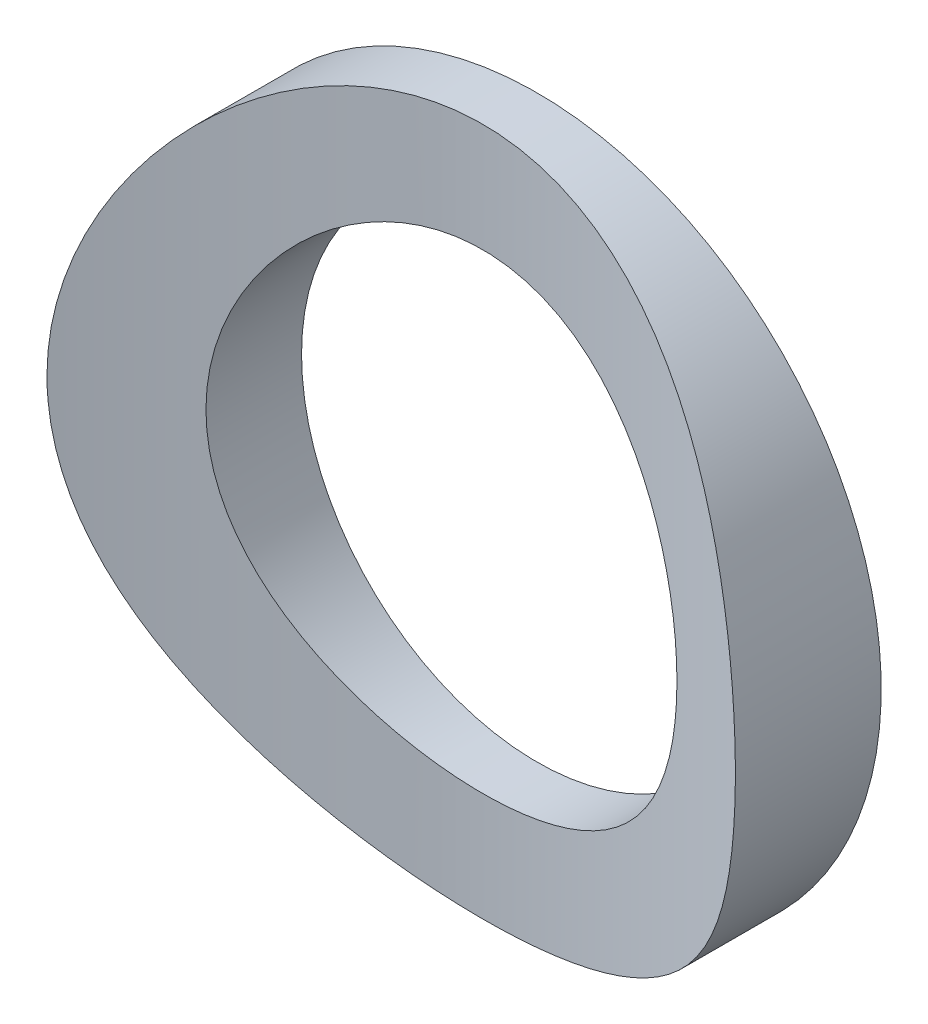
ISO-10303-21;
HEADER;
FILE_DESCRIPTION(('STEP AP214'),'2;1');
FILE_NAME('part.step','',(''),(''),'','','');
FILE_SCHEMA(('AUTOMOTIVE_DESIGN { 1 0 10303 214 1 1 1 1 }'));
ENDSEC;
DATA;
#1=APPLICATION_CONTEXT('core data for automotive mechanical design processes');
#2=APPLICATION_PROTOCOL_DEFINITION('international standard','automotive_design',2000,#1);
#3=PRODUCT_CONTEXT('',#1,'mechanical');
#4=PRODUCT('Part','Part','',(#3));
#5=PRODUCT_RELATED_PRODUCT_CATEGORY('part','',(#4));
#6=PRODUCT_DEFINITION_FORMATION('','',#4);
#7=PRODUCT_DEFINITION_CONTEXT('part definition',#1,'design');
#8=PRODUCT_DEFINITION('design','',#6,#7);
#9=PRODUCT_DEFINITION_SHAPE('','',#8);
#10=(LENGTH_UNIT() NAMED_UNIT(*) SI_UNIT(.MILLI.,.METRE.));
#11=(NAMED_UNIT(*) PLANE_ANGLE_UNIT() SI_UNIT($,.RADIAN.));
#12=(NAMED_UNIT(*) SI_UNIT($,.STERADIAN.) SOLID_ANGLE_UNIT());
#13=UNCERTAINTY_MEASURE_WITH_UNIT(LENGTH_MEASURE(1.E-05),#10,'distance_accuracy_value','');
#14=(GEOMETRIC_REPRESENTATION_CONTEXT(3) GLOBAL_UNCERTAINTY_ASSIGNED_CONTEXT((#13)) GLOBAL_UNIT_ASSIGNED_CONTEXT((#10,
#11,#12)) REPRESENTATION_CONTEXT('',''));
#15=CARTESIAN_POINT('',(0.,0.,0.));
#16=DIRECTION('',(0.,0.,1.));
#17=DIRECTION('',(1.,0.,0.));
#18=AXIS2_PLACEMENT_3D('',#15,#16,#17);
#19=CARTESIAN_POINT('',(0.,0.,8.10098934));
#20=DIRECTION('',(0.,0.,-1.));
#21=DIRECTION('',(-1.,0.,0.));
#22=AXIS2_PLACEMENT_3D('',#19,#20,#21);
#23=CYLINDRICAL_SURFACE('',#22,19.);
#24=CARTESIAN_POINT('',(0.,0.,0.));
#25=DIRECTION('',(0.,0.,-1.));
#26=DIRECTION('',(-1.,0.,0.));
#27=AXIS2_PLACEMENT_3D('',#24,#25,#26);
#28=CIRCLE('',#27,19.);
#29=CARTESIAN_POINT('',(-19.,0.,0.));
#30=VERTEX_POINT('',#29);
#31=EDGE_CURVE('E34',#30,#30,#28,.F.);
#32=ORIENTED_EDGE('',*,*,#31,.T.);
#33=EDGE_LOOP('',(#32));
#34=FACE_BOUND('',#33,.T.);
#35=CARTESIAN_POINT('',(-19.0000000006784,4.08830792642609E-09,8.05267330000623));
#36=CARTESIAN_POINT('',(-18.9999957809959,0.49602409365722,8.05266820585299));
#37=CARTESIAN_POINT('',(-18.9805477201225,0.99213072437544,8.04151664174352));
#38=CARTESIAN_POINT('',(-18.9030126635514,1.98038550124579,7.99732287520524));
#39=CARTESIAN_POINT('',(-18.8449169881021,2.47253273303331,7.96427575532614));
#40=CARTESIAN_POINT('',(-18.6907887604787,3.44952723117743,7.87748548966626));
#41=CARTESIAN_POINT('',(-18.594715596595,3.9343661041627,7.82372019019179));
#42=CARTESIAN_POINT('',(-18.3658340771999,4.89273805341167,7.69741920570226));
#43=CARTESIAN_POINT('',(-18.2330270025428,5.36627152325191,7.6248841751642));
#44=CARTESIAN_POINT('',(-17.9328901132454,6.29676602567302,7.46386720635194));
#45=CARTESIAN_POINT('',(-17.7657355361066,6.75379785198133,7.37546649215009));
#46=CARTESIAN_POINT('',(-17.3980693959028,7.65129925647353,7.18517214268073));
#47=CARTESIAN_POINT('',(-17.1975576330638,8.09176873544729,7.0832784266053));
#48=CARTESIAN_POINT('',(-16.764768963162,8.95406278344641,6.86885237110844));
#49=CARTESIAN_POINT('',(-16.5324933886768,9.37588813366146,6.75632047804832));
#50=CARTESIAN_POINT('',(-16.0376197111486,10.1992934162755,6.52346764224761));
#51=CARTESIAN_POINT('',(-15.7750104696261,10.6008658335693,6.40314384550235));
#52=CARTESIAN_POINT('',(-15.19850700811,11.4137366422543,6.1476473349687));
#53=CARTESIAN_POINT('',(-14.8821807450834,11.8231821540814,6.0120618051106));
#54=CARTESIAN_POINT('',(-14.2176137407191,12.61453379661,5.73871939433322));
#55=CARTESIAN_POINT('',(-13.8693713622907,12.9964385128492,5.60096240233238));
#56=CARTESIAN_POINT('',(-13.1424718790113,13.7310814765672,5.32662444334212));
#57=CARTESIAN_POINT('',(-12.7637963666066,14.0838018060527,5.19004424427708));
#58=CARTESIAN_POINT('',(-11.9781225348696,14.7577905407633,4.92150744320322));
#59=CARTESIAN_POINT('',(-11.5711337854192,15.0790694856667,4.78954930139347));
#60=CARTESIAN_POINT('',(-10.7025617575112,15.7086501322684,4.52484189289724));
#61=CARTESIAN_POINT('',(-10.2391476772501,16.0146578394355,4.39262664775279));
#62=CARTESIAN_POINT('',(-9.2847249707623,16.5862378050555,4.14070250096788));
#63=CARTESIAN_POINT('',(-8.7937147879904,16.851807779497,4.0209943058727));
#64=CARTESIAN_POINT('',(-7.78746216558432,17.3397784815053,3.79758517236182));
#65=CARTESIAN_POINT('',(-7.27223139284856,17.5621997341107,3.69387662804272));
#66=CARTESIAN_POINT('',(-6.22104369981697,17.9614758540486,3.50551562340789));
#67=CARTESIAN_POINT('',(-5.68508895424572,18.1383354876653,3.42086116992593));
#68=CARTESIAN_POINT('',(-4.63509149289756,18.4334494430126,3.27844384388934));
#69=CARTESIAN_POINT('',(-4.1221606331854,18.554951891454,3.21920787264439));
#70=CARTESIAN_POINT('',(-3.08607445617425,18.7551184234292,3.12114830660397));
#71=CARTESIAN_POINT('',(-2.56291957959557,18.8337843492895,3.08232383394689));
#72=CARTESIAN_POINT('',(-1.51098362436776,18.9472070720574,3.02622826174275));
#73=CARTESIAN_POINT('',(-0.982205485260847,18.9819857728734,3.00894641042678));
#74=CARTESIAN_POINT('',(0.0766553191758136,19.0072229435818,2.99641339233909));
#75=CARTESIAN_POINT('',(0.606737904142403,18.9976840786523,3.00116090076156));
#76=CARTESIAN_POINT('',(1.61811462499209,18.937155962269,3.03118532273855));
#77=CARTESIAN_POINT('',(2.09968508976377,18.8898009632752,3.05466210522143));
#78=CARTESIAN_POINT('',(3.05661660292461,18.7587388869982,3.11930987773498));
#79=CARTESIAN_POINT('',(3.53197808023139,18.6750343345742,3.16047963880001));
#80=CARTESIAN_POINT('',(4.47329598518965,18.4721807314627,3.25952570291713));
#81=CARTESIAN_POINT('',(4.93925214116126,18.3530306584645,3.31740248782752));
#82=CARTESIAN_POINT('',(5.85882029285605,18.0804928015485,3.44851250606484));
#83=CARTESIAN_POINT('',(6.31243184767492,17.9271037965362,3.52174628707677));
#84=CARTESIAN_POINT('',(7.21088778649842,17.5851457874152,3.68303562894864));
#85=CARTESIAN_POINT('',(7.65552244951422,17.3961171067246,3.77128319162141));
#86=CARTESIAN_POINT('',(8.52701465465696,16.9859347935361,3.9599031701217));
#87=CARTESIAN_POINT('',(8.95387221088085,16.7647811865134,4.06027557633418));
#88=CARTESIAN_POINT('',(9.78786071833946,16.2919495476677,4.27101507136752));
#89=CARTESIAN_POINT('',(10.1949872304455,16.0402646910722,4.38138439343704));
#90=CARTESIAN_POINT('',(10.9876701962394,15.5080320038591,4.60980644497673));
#91=CARTESIAN_POINT('',(11.3732245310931,15.2274813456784,4.72785992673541));
#92=CARTESIAN_POINT('',(12.156173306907,14.6115772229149,4.9805280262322));
#93=CARTESIAN_POINT('',(12.5513022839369,14.2735522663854,5.11565888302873));
#94=CARTESIAN_POINT('',(13.3120225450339,13.5668577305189,5.38893550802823));
#95=CARTESIAN_POINT('',(13.6776120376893,13.1981862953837,5.52708145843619));
#96=CARTESIAN_POINT('',(14.3778118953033,12.4317412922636,5.8030991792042));
#97=CARTESIAN_POINT('',(14.712393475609,12.0339412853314,5.9409705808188));
#98=CARTESIAN_POINT('',(15.3484241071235,11.2114291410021,6.21276266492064));
#99=CARTESIAN_POINT('',(15.6498740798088,10.7867177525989,6.34668345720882));
#100=CARTESIAN_POINT('',(16.2356638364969,9.88484576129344,6.61510504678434));
#101=CARTESIAN_POINT('',(16.5177434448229,9.40606629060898,6.74911505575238));
#102=CARTESIAN_POINT('',(17.0401401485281,8.42279931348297,7.00411448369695));
#103=CARTESIAN_POINT('',(17.2804516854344,7.91830839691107,7.12510216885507));
#104=CARTESIAN_POINT('',(17.7164162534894,6.88774562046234,7.34939353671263));
#105=CARTESIAN_POINT('',(17.9121536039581,6.36171676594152,7.45273051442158));
#106=CARTESIAN_POINT('',(18.2570791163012,5.29103418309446,7.63779979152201));
#107=CARTESIAN_POINT('',(18.4062877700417,4.74638877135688,7.71954159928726));
#108=CARTESIAN_POINT('',(18.6086176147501,3.85260630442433,7.83159833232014));
#109=CARTESIAN_POINT('',(18.676712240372,3.50774791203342,7.86965562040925));
#110=CARTESIAN_POINT('',(18.7937765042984,2.81383996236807,7.93542348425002));
#111=CARTESIAN_POINT('',(18.8427488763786,2.46479101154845,7.9631355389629));
#112=CARTESIAN_POINT('',(18.9212400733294,1.76381852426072,8.00768936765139));
#113=CARTESIAN_POINT('',(18.9507588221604,1.41189497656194,8.02453109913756));
#114=CARTESIAN_POINT('',(18.9901388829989,0.706661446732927,8.04702407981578));
#115=CARTESIAN_POINT('',(19.0000030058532,0.353351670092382,8.05267692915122));
#116=CARTESIAN_POINT('',(18.9999957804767,-0.496024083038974,8.05266820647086));
#117=CARTESIAN_POINT('',(18.9805477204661,-0.992130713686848,8.04151664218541));
#118=CARTESIAN_POINT('',(18.9030126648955,-1.9803854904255,7.99732287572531));
#119=CARTESIAN_POINT('',(18.8449169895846,-2.47253272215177,7.96427575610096));
#120=CARTESIAN_POINT('',(18.6907887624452,-3.44952722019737,7.8774854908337));
#121=CARTESIAN_POINT('',(18.5947155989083,-3.93436609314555,7.82372019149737));
#122=CARTESIAN_POINT('',(18.3658340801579,-4.89273804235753,7.69741920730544));
#123=CARTESIAN_POINT('',(18.2330270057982,-5.36627151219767,7.62488417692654));
#124=CARTESIAN_POINT('',(17.9328901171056,-6.29676601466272,7.46386720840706));
#125=CARTESIAN_POINT('',(17.765735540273,-6.75379784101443,7.37546649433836));
#126=CARTESIAN_POINT('',(17.3980694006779,-7.65129924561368,7.18517214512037));
#127=CARTESIAN_POINT('',(17.1975576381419,-8.09176872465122,7.08327842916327));
#128=CARTESIAN_POINT('',(16.7647689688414,-8.95406277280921,6.86885237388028));
#129=CARTESIAN_POINT('',(16.5324933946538,-9.37588812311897,6.7563204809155));
#130=CARTESIAN_POINT('',(16.0376197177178,-10.199293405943,6.52346764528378));
#131=CARTESIAN_POINT('',(15.77501047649,-10.6008658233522,6.40314384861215));
#132=CARTESIAN_POINT('',(15.1985070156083,-11.4137366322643,6.14764733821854));
#133=CARTESIAN_POINT('',(14.882180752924,-11.8231821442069,6.01206180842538));
#134=CARTESIAN_POINT('',(14.2176137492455,-12.6145337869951,5.73871939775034));
#135=CARTESIAN_POINT('',(13.8693713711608,-12.9964385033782,5.6009624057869));
#136=CARTESIAN_POINT('',(13.142471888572,-13.7310814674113,5.32662444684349));
#137=CARTESIAN_POINT('',(12.7637963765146,-14.0838017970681,5.19004424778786));
#138=CARTESIAN_POINT('',(11.9781225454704,-14.7577905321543,4.92150744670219));
#139=CARTESIAN_POINT('',(11.5711337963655,-15.0790694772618,4.78954930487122));
#140=CARTESIAN_POINT('',(10.7025617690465,-15.7086501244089,4.52484189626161));
#141=CARTESIAN_POINT('',(10.2391476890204,-16.0146578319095,4.39262665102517));
#142=CARTESIAN_POINT('',(9.28472498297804,-16.5862377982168,4.14070250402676));
#143=CARTESIAN_POINT('',(8.79371480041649,-16.8518077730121,4.02099430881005));
#144=CARTESIAN_POINT('',(7.78746217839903,-17.3397784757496,3.79758517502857));
#145=CARTESIAN_POINT('',(7.27223140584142,-17.5621997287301,3.69387663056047));
#146=CARTESIAN_POINT('',(6.2210437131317,-17.9614758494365,3.50551562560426));
#147=CARTESIAN_POINT('',(5.68508896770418,-18.1383354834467,3.42086117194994));
#148=CARTESIAN_POINT('',(4.63509150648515,-18.433449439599,3.27844384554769));
#149=CARTESIAN_POINT('',(4.12216064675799,-18.5549518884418,3.2192078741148));
#150=CARTESIAN_POINT('',(3.08607446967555,-18.7551184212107,3.12114830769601));
#151=CARTESIAN_POINT('',(2.56291959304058,-18.8337843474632,3.08232383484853));
#152=CARTESIAN_POINT('',(1.51098363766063,-18.9472070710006,3.02622826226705));
#153=CARTESIAN_POINT('',(0.982205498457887,-18.981985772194,3.00894641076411));
#154=CARTESIAN_POINT('',(-0.076655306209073,-19.0072229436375,2.99641339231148));
#155=CARTESIAN_POINT('',(-0.606737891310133,-18.9976840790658,3.00116090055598));
#156=CARTESIAN_POINT('',(-1.618114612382,-18.9371559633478,3.03118532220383));
#157=CARTESIAN_POINT('',(-2.09968507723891,-18.8898009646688,3.0546621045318));
#158=CARTESIAN_POINT('',(-3.05661659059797,-18.7587388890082,3.11930987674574));
#159=CARTESIAN_POINT('',(-3.53197806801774,-18.6750343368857,3.16047963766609));
#160=CARTESIAN_POINT('',(-4.47329597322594,-18.4721807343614,3.25952570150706));
#161=CARTESIAN_POINT('',(-4.93925212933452,-18.353030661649,3.31740248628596));
#162=CARTESIAN_POINT('',(-5.85882028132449,-18.0804928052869,3.44851250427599));
#163=CARTESIAN_POINT('',(-6.31243183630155,-17.9271038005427,3.52174628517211));
#164=CARTESIAN_POINT('',(-7.2108877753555,-17.5851457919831,3.68303562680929));
#165=CARTESIAN_POINT('',(-7.65552243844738,-17.3961171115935,3.77128318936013));
#166=CARTESIAN_POINT('',(-8.52701464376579,-16.9859347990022,3.95990316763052));
#167=CARTESIAN_POINT('',(-8.95387220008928,-16.7647811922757,4.06027557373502));
#168=CARTESIAN_POINT('',(-9.78786070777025,-16.291949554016,4.271015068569));
#169=CARTESIAN_POINT('',(-10.194987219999,-16.0402646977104,4.38138439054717));
#170=CARTESIAN_POINT('',(-10.9876701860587,-15.5080320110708,4.60980644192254));
#171=CARTESIAN_POINT('',(-11.3732245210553,-15.2274813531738,4.72785992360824));
#172=CARTESIAN_POINT('',(-12.1561732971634,-14.611577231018,4.98052802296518));
#173=CARTESIAN_POINT('',(-12.5513022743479,-14.2735522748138,5.11565887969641));
#174=CARTESIAN_POINT('',(-13.3120225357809,-13.5668577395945,5.38893550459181));
#175=CARTESIAN_POINT('',(-13.6776120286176,-13.1981863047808,5.52708145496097));
#176=CARTESIAN_POINT('',(-14.3778118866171,-12.4317413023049,5.80309917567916));
#177=CARTESIAN_POINT('',(-14.7123934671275,-12.0339412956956,5.94097057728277));
#178=CARTESIAN_POINT('',(-15.3484240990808,-11.2114291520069,6.21276266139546));
#179=CARTESIAN_POINT('',(-15.6498740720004,-10.7867177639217,6.34668345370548));
#180=CARTESIAN_POINT('',(-16.2356638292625,-9.88484577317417,6.61510504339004));
#181=CARTESIAN_POINT('',(-16.5177434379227,-9.40606630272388,6.74911505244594));
#182=CARTESIAN_POINT('',(-17.0401401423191,-8.42279932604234,7.00411448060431));
#183=CARTESIAN_POINT('',(-17.2804516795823,-7.91830840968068,7.12510216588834));
#184=CARTESIAN_POINT('',(-17.7164162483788,-6.88774563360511,7.34939353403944));
#185=CARTESIAN_POINT('',(-17.9121535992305,-6.36171677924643,7.4527305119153));
#186=CARTESIAN_POINT('',(-18.2570791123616,-5.29103419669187,7.6377997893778));
#187=CARTESIAN_POINT('',(-18.4062877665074,-4.74638878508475,7.71954159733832));
#188=CARTESIAN_POINT('',(-18.6086176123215,-3.85260631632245,7.83159833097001));
#189=CARTESIAN_POINT('',(-18.6767122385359,-3.50774792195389,7.86965561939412));
#190=CARTESIAN_POINT('',(-18.7937765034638,-2.81383996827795,7.9354234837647));
#191=CARTESIAN_POINT('',(-18.8427488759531,-2.46479101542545,7.9631355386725));
#192=CARTESIAN_POINT('',(-18.9212400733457,-1.76381852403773,8.00768936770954));
#193=CARTESIAN_POINT('',(-18.9507588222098,-1.41189497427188,8.02453109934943));
#194=CARTESIAN_POINT('',(-18.9901388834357,-0.70666144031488,8.04702407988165));
#195=CARTESIAN_POINT('',(-19.000003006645,-0.353351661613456,8.05267692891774));
#196=CARTESIAN_POINT('',(-19.0000000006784,4.08830792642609E-09,8.05267330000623));
#197=B_SPLINE_CURVE_WITH_KNOTS('',3,(#35,#36,#37,#38,#39,#40,#41,#42,#43,#44,#45,#46,#47,#48,
#49,#50,#51,#52,#53,#54,#55,#56,#57,#58,#59,#60,#61,#62,#63,#64,#65,#66,#67,#68,#69,#70,#71,#72,
#73,#74,#75,#76,#77,#78,#79,#80,#81,#82,#83,#84,#85,#86,#87,#88,#89,#90,#91,#92,#93,#94,#95,#96,
#97,#98,#99,#100,#101,#102,#103,#104,#105,#106,#107,#108,#109,#110,#111,#112,#113,#114,#115,
#116,#117,#118,#119,#120,#121,#122,#123,#124,#125,#126,#127,#128,#129,#130,#131,#132,#133,#134,
#135,#136,#137,#138,#139,#140,#141,#142,#143,#144,#145,#146,#147,#148,#149,#150,#151,#152,#153,
#154,#155,#156,#157,#158,#159,#160,#161,#162,#163,#164,#165,#166,#167,#168,#169,#170,#171,#172,
#173,#174,#175,#176,#177,#178,#179,#180,#181,#182,#183,#184,#185,#186,#187,#188,#189,#190,#191,
#192,#193,#194,#195,#196),.UNSPECIFIED.,.T.,.F.,(4,2,2,2,2,2,2,2,2,2,2,2,2,2,2,2,2,2,2,2,2,2,2,
2,2,2,2,2,2,2,2,2,2,2,2,2,2,2,2,2,2,2,2,2,2,2,2,2,2,2,2,2,2,2,2,2,2,2,2,2,2,2,2,2,2,2,2,2,2,2,2,
2,2,2,2,2,2,2,2,2,4),(0.,1.48771397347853,2.97576218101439,4.46540597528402,5.95499783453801,
7.4371706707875,8.9193523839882,10.4014719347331,11.8841374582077,13.4870586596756,
15.0900621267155,16.6940425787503,18.2974834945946,20.0078474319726,21.7183079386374,
23.4279528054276,25.1374187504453,26.7265962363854,28.3157053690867,29.904021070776,
31.4922412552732,32.9439124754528,34.3954828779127,35.847095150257,37.2987592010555,
38.7706159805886,40.2424715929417,41.7146568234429,43.1869864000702,44.797025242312,
46.4071616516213,48.0187780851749,49.6303496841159,51.3430337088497,53.0559454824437,
54.7655895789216,56.4744796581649,57.5345784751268,58.5945256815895,59.6544770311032,
60.7142767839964,62.2019907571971,63.690038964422,65.1796827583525,66.6692746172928,
68.1514474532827,69.6336291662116,71.1157487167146,72.5984142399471,74.2013354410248,
75.8043389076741,77.408319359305,79.0117602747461,80.7221242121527,82.432584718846,
84.1422295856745,85.8516955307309,87.4408730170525,89.0299821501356,90.6182978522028,
92.2065180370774,93.6581892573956,95.1097596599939,96.5613719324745,98.0130359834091,
99.4848927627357,100.956748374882,102.428933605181,103.901263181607,105.511302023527,
107.121438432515,108.733054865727,110.344626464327,112.05731048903,113.770222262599,
115.479866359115,117.188756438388,118.248855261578,119.308802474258,120.368753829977,
121.428553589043),.UNSPECIFIED.);
#198=CARTESIAN_POINT('',(-19.0000000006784,4.08830792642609E-09,8.05267330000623));
#199=VERTEX_POINT('',#198);
#200=EDGE_CURVE('E43',#199,#199,#197,.T.);
#201=ORIENTED_EDGE('',*,*,#200,.T.);
#202=EDGE_LOOP('',(#201));
#203=FACE_BOUND('',#202,.T.);
#204=ADVANCED_FACE('F30',(#34,#203),#23,.T.);
#205=CARTESIAN_POINT('',(-19.228,-19.29416296,0.));
#206=DIRECTION('',(0.,0.,1.));
#207=DIRECTION('',(1.,0.,0.));
#208=AXIS2_PLACEMENT_3D('',#205,#206,#207);
#209=PLANE('',#208);
#210=CARTESIAN_POINT('',(0.,0.,0.));
#211=DIRECTION('',(0.,0.,-1.));
#212=DIRECTION('',(-1.,0.,0.));
#213=AXIS2_PLACEMENT_3D('',#210,#211,#212);
#214=CIRCLE('',#213,13.);
#215=CARTESIAN_POINT('',(-13.,0.,0.));
#216=VERTEX_POINT('',#215);
#217=EDGE_CURVE('E38',#216,#216,#214,.F.);
#218=ORIENTED_EDGE('',*,*,#217,.T.);
#219=EDGE_LOOP('',(#218));
#220=FACE_BOUND('',#219,.T.);
#221=ORIENTED_EDGE('',*,*,#31,.F.);
#222=EDGE_LOOP('',(#221));
#223=FACE_BOUND('',#222,.T.);
#224=ADVANCED_FACE('F32',(#220,#223),#209,.F.);
#225=CARTESIAN_POINT('',(0.,-19.2283897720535,41.25));
#226=DIRECTION('',(0.,1.,0.));
#227=DIRECTION('',(0.,0.,1.));
#228=AXIS2_PLACEMENT_3D('',#225,#226,#227);
#229=CYLINDRICAL_SURFACE('',#228,38.25);
#230=CARTESIAN_POINT('',(13.0000000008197,8.88697038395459E-10,5.27691978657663));
#231=CARTESIAN_POINT('',(12.9999999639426,-0.35324621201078,5.27691971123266));
#232=CARTESIAN_POINT('',(12.9855896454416,-0.706494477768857,5.27170234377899));
#233=CARTESIAN_POINT('',(12.9280833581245,-1.4104730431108,5.25099879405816));
#234=CARTESIAN_POINT('',(12.8849766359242,-1.76120234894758,5.23550876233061));
#235=CARTESIAN_POINT('',(12.7704105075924,-2.45793391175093,5.19472565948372));
#236=CARTESIAN_POINT('',(12.6989103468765,-2.8039286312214,5.16941849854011));
#237=CARTESIAN_POINT('',(12.5282306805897,-3.48823757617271,5.10979948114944));
#238=CARTESIAN_POINT('',(12.4290497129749,-3.82655139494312,5.07548714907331));
#239=CARTESIAN_POINT('',(12.2041972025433,-4.49229151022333,4.99901218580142));
#240=CARTESIAN_POINT('',(12.0785986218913,-4.81974497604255,4.95687121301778));
#241=CARTESIAN_POINT('',(11.8017706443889,-5.4626654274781,4.86591114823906));
#242=CARTESIAN_POINT('',(11.6505407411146,-5.77813217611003,4.81709192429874));
#243=CARTESIAN_POINT('',(11.3236303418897,-6.39509513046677,4.71416501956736));
#244=CARTESIAN_POINT('',(11.147957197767,-6.69659550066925,4.66005893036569));
#245=CARTESIAN_POINT('',(10.7732673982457,-7.28410234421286,4.54799122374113));
#246=CARTESIAN_POINT('',(10.5742429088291,-7.57010357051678,4.49002831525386));
#247=CARTESIAN_POINT('',(10.1463858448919,-8.13517289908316,4.36959140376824));
#248=CARTESIAN_POINT('',(9.91672368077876,-8.41359451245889,4.30702985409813));
#249=CARTESIAN_POINT('',(9.4351567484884,-8.95029686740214,4.18111485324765));
#250=CARTESIAN_POINT('',(9.18325152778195,-9.20857719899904,4.11776138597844));
#251=CARTESIAN_POINT('',(8.65862792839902,-9.70351780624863,3.99193455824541));
#252=CARTESIAN_POINT('',(8.38590144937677,-9.94016958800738,3.92946155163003));
#253=CARTESIAN_POINT('',(7.82145300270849,-10.3901442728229,3.8071004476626));
#254=CARTESIAN_POINT('',(7.52973771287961,-10.6034753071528,3.74721145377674));
#255=CARTESIAN_POINT('',(6.92071477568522,-11.0109763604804,3.62999245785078));
#256=CARTESIAN_POINT('',(6.60292415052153,-11.2044587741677,3.57277799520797));
#257=CARTESIAN_POINT('',(5.95112082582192,-11.5638515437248,3.46434401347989));
#258=CARTESIAN_POINT('',(5.61710774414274,-11.7297612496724,3.41312463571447));
#259=CARTESIAN_POINT('',(4.93523223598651,-12.0325644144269,3.31816070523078));
#260=CARTESIAN_POINT('',(4.58737289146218,-12.1694642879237,3.2744145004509));
#261=CARTESIAN_POINT('',(3.8802658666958,-12.4130313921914,3.19566314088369));
#262=CARTESIAN_POINT('',(3.52101869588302,-12.5196999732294,3.16065759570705));
#263=CARTESIAN_POINT('',(2.80699492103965,-12.6984765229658,3.10151441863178));
#264=CARTESIAN_POINT('',(2.45252409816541,-12.7716918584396,3.07703046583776));
#265=CARTESIAN_POINT('',(1.7381808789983,-12.8883547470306,3.03784014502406));
#266=CARTESIAN_POINT('',(1.37830860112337,-12.9318029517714,3.02313356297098));
#267=CARTESIAN_POINT('',(0.656003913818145,-12.9884897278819,3.00391976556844));
#268=CARTESIAN_POINT('',(0.293572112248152,-13.0017352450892,2.99941020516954));
#269=CARTESIAN_POINT('',(-0.431108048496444,-12.9979009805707,3.00071342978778));
#270=CARTESIAN_POINT('',(-0.793356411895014,-12.9808219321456,3.00652596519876));
#271=CARTESIAN_POINT('',(-1.50011444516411,-12.9178307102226,3.02785950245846));
#272=CARTESIAN_POINT('',(-1.84474463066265,-12.8731238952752,3.04297454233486));
#273=CARTESIAN_POINT('',(-2.52881682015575,-12.7563895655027,3.08214764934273));
#274=CARTESIAN_POINT('',(-2.8682589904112,-12.6843629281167,3.10620542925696));
#275=CARTESIAN_POINT('',(-3.53966262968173,-12.5136239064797,3.16264253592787));
#276=CARTESIAN_POINT('',(-3.87162379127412,-12.4149104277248,3.19502220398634));
#277=CARTESIAN_POINT('',(-4.52589145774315,-12.191628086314,3.26727834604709));
#278=CARTESIAN_POINT('',(-4.84819774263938,-12.0670586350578,3.30715499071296));
#279=CARTESIAN_POINT('',(-5.48538802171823,-11.7912109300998,3.39398602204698));
#280=CARTESIAN_POINT('',(-5.8001148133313,-11.6395973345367,3.44102804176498));
#281=CARTESIAN_POINT('',(-6.41568095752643,-11.3119676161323,3.54060112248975));
#282=CARTESIAN_POINT('',(-6.71652025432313,-11.1359513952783,3.59313220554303));
#283=CARTESIAN_POINT('',(-7.30257230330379,-10.7607388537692,3.70237960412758));
#284=CARTESIAN_POINT('',(-7.58778495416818,-10.5615423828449,3.7590959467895));
#285=CARTESIAN_POINT('',(-8.14108654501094,-10.1411772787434,3.87534053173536));
#286=CARTESIAN_POINT('',(-8.40916884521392,-9.9200002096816,3.93486984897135));
#287=CARTESIAN_POINT('',(-8.93911688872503,-9.44587861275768,4.05816975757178));
#288=CARTESIAN_POINT('',(-9.2000570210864,-9.19191571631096,4.12200632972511));
#289=CARTESIAN_POINT('',(-9.6998722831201,-8.66285037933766,4.24943863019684));
#290=CARTESIAN_POINT('',(-9.93873700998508,-8.38773808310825,4.31303423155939));
#291=CARTESIAN_POINT('',(-10.3928632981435,-7.81800253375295,4.43822998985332));
#292=CARTESIAN_POINT('',(-10.6081124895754,-7.52336918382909,4.49982908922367));
#293=CARTESIAN_POINT('',(-11.0133043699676,-6.91665619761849,4.61921743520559));
#294=CARTESIAN_POINT('',(-11.2032589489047,-6.60458485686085,4.67700846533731));
#295=CARTESIAN_POINT('',(-11.5595140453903,-5.95949895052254,4.78802610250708));
#296=CARTESIAN_POINT('',(-11.7253705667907,-5.62622307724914,4.84116123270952));
#297=CARTESIAN_POINT('',(-12.0281644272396,-4.94589001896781,4.94006832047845));
#298=CARTESIAN_POINT('',(-12.1651139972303,-4.59883873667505,4.98584339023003));
#299=CARTESIAN_POINT('',(-12.4087325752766,-3.8938678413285,5.06847996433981));
#300=CARTESIAN_POINT('',(-12.5154508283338,-3.53596696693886,5.10535595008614));
#301=CARTESIAN_POINT('',(-12.6978054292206,-2.81160807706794,5.16901349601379));
#302=CARTESIAN_POINT('',(-12.7734560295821,-2.44515406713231,5.19579968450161));
#303=CARTESIAN_POINT('',(-12.8886217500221,-1.73318203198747,5.23681665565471));
#304=CARTESIAN_POINT('',(-12.9303534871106,-1.38806522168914,5.25181499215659));
#305=CARTESIAN_POINT('',(-12.9860426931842,-0.695299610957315,5.27186661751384));
#306=CARTESIAN_POINT('',(-13.0000000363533,-0.347650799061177,5.27691986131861));
#307=CARTESIAN_POINT('',(-12.9999999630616,0.353246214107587,5.27691971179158));
#308=CARTESIAN_POINT('',(-12.9855896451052,0.706494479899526,5.27170234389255));
#309=CARTESIAN_POINT('',(-12.9280833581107,1.41047304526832,5.25099879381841));
#310=CARTESIAN_POINT('',(-12.8849766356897,1.76120235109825,5.23550876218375));
#311=CARTESIAN_POINT('',(-12.7704105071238,2.45793391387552,5.19472565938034));
#312=CARTESIAN_POINT('',(-12.6989103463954,2.80392863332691,5.16941849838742));
#313=CARTESIAN_POINT('',(-12.5282306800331,3.48823757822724,5.10979948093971));
#314=CARTESIAN_POINT('',(-12.429049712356,3.82655139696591,5.07548714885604));
#315=CARTESIAN_POINT('',(-12.2041972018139,4.49229151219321,4.99901218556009));
#316=CARTESIAN_POINT('',(-12.0785986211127,4.81974497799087,4.95687121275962));
#317=CARTESIAN_POINT('',(-11.8017706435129,5.4626654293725,4.86591114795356));
#318=CARTESIAN_POINT('',(-11.6505407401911,5.77813217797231,4.81709192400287));
#319=CARTESIAN_POINT('',(-11.3236303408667,6.39509513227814,4.71416501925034));
#320=CARTESIAN_POINT('',(-11.1479571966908,6.69659550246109,4.66005893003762));
#321=CARTESIAN_POINT('',(-10.7732673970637,7.28410234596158,4.54799122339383));
#322=CARTESIAN_POINT('',(-10.5742429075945,7.5701035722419,4.49002831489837));
#323=CARTESIAN_POINT('',(-10.1463858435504,8.13517290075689,4.36959140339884));
#324=CARTESIAN_POINT('',(-9.91672367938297,8.41359451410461,4.3070298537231));
#325=CARTESIAN_POINT('',(-9.43515674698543,8.95029686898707,4.18111485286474));
#326=CARTESIAN_POINT('',(-9.18325152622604,9.20857720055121,4.11776138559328));
#327=CARTESIAN_POINT('',(-8.65862792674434,9.70351780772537,3.99193455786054));
#328=CARTESIAN_POINT('',(-8.38590144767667,9.9401695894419,3.9294615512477));
#329=CARTESIAN_POINT('',(-7.82145300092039,10.3901442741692,3.80710044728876));
#330=CARTESIAN_POINT('',(-7.52973771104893,10.6034753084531,3.74721145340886));
#331=CARTESIAN_POINT('',(-6.9207147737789,11.0109763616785,3.62999245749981));
#332=CARTESIAN_POINT('',(-6.60292414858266,11.2044587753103,3.57277799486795));
#333=CARTESIAN_POINT('',(-5.95112082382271,11.5638515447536,3.46434401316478));
#334=CARTESIAN_POINT('',(-5.61710774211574,11.729761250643,3.41312463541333));
#335=CARTESIAN_POINT('',(-4.9352322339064,12.0325644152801,3.31816070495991));
#336=CARTESIAN_POINT('',(-4.58737288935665,12.1694642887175,3.27441450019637));
#337=CARTESIAN_POINT('',(-3.8802658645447,12.4130313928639,3.19566314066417));
#338=CARTESIAN_POINT('',(-3.52101869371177,12.5196999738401,3.16065759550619));
#339=CARTESIAN_POINT('',(-2.80699491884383,12.6984765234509,3.10151441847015));
#340=CARTESIAN_POINT('',(-2.45252409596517,12.7716918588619,3.0770304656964));
#341=CARTESIAN_POINT('',(-1.73818087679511,12.8883547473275,3.03784014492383));
#342=CARTESIAN_POINT('',(-1.37830859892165,12.9318029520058,3.02313356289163));
#343=CARTESIAN_POINT('',(-0.656003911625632,12.9884897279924,3.00391976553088));
#344=CARTESIAN_POINT('',(-0.293572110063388,13.0017352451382,2.99941020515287));
#345=CARTESIAN_POINT('',(0.431108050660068,12.9979009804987,3.00071342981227));
#346=CARTESIAN_POINT('',(0.793356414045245,12.9808219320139,3.00652596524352));
#347=CARTESIAN_POINT('',(1.50011444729,12.9178307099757,3.02785950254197));
#348=CARTESIAN_POINT('',(1.84474463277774,12.873123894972,3.04297454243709));
#349=CARTESIAN_POINT('',(2.52881682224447,12.7563895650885,3.08214764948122));
#350=CARTESIAN_POINT('',(2.86825899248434,12.6843629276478,3.106205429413));
#351=CARTESIAN_POINT('',(3.53966263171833,12.5136239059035,3.1626425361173));
#352=CARTESIAN_POINT('',(3.87162379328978,12.414910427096,3.1950222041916));
#353=CARTESIAN_POINT('',(4.52589145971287,12.1916280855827,3.26727834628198));
#354=CARTESIAN_POINT('',(4.84819774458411,12.0670586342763,3.30715499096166));
#355=CARTESIAN_POINT('',(5.48538802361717,11.7912109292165,3.39398602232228));
#356=CARTESIAN_POINT('',(5.80011481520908,11.6395973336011,3.44102804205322));
#357=CARTESIAN_POINT('',(6.41568095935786,11.3119676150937,3.54060112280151));
#358=CARTESIAN_POINT('',(6.71652025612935,11.135951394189,3.59313220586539));
#359=CARTESIAN_POINT('',(7.30257230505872,10.7607388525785,3.70237960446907));
#360=CARTESIAN_POINT('',(7.58778495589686,10.5615423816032,3.75909594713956));
#361=CARTESIAN_POINT('',(8.14108654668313,10.1411772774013,3.87534053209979));
#362=CARTESIAN_POINT('',(8.40916884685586,9.92000020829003,3.93486984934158));
#363=CARTESIAN_POINT('',(8.9391168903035,9.44587861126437,4.05816975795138));
#364=CARTESIAN_POINT('',(9.20005702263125,9.19191571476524,4.12200633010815));
#365=CARTESIAN_POINT('',(9.69987228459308,8.6628503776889,4.24943863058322));
#366=CARTESIAN_POINT('',(9.93873701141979,8.38773808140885,4.31303423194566));
#367=CARTESIAN_POINT('',(10.3928632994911,7.8180025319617,4.43822999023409));
#368=CARTESIAN_POINT('',(10.6081124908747,7.52336918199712,4.4998290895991));
#369=CARTESIAN_POINT('',(11.0133043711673,6.91665619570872,4.61921743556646));
#370=CARTESIAN_POINT('',(11.203258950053,6.604584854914,4.67700846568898));
#371=CARTESIAN_POINT('',(11.5595140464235,5.9594989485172,4.78802610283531));
#372=CARTESIAN_POINT('',(11.7253705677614,5.62622307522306,4.84116123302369));
#373=CARTESIAN_POINT('',(12.028164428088,4.9458900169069,4.94006832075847));
#374=CARTESIAN_POINT('',(12.1651139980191,4.5988387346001,4.98584339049));
#375=CARTESIAN_POINT('',(12.4087325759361,3.89386783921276,5.06847996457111));
#376=CARTESIAN_POINT('',(12.515450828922,3.53596696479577,5.10535595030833));
#377=CARTESIAN_POINT('',(12.697805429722,2.81160807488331,5.16901349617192));
#378=CARTESIAN_POINT('',(12.7734560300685,2.44515406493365,5.19579968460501));
#379=CARTESIAN_POINT('',(12.8886217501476,1.73318203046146,5.2368166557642));
#380=CARTESIAN_POINT('',(12.9303534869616,1.38806522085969,5.25181499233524));
#381=CARTESIAN_POINT('',(12.9860426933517,0.695299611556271,5.27186661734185));
#382=CARTESIAN_POINT('',(13.0000000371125,0.347650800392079,5.27691986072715));
#383=CARTESIAN_POINT('',(13.0000000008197,8.88697038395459E-10,5.27691978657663));
#384=B_SPLINE_CURVE_WITH_KNOTS('',3,(#230,#231,#232,#233,#234,#235,#236,#237,#238,#239,#240,
#241,#242,#243,#244,#245,#246,#247,#248,#249,#250,#251,#252,#253,#254,#255,#256,#257,#258,#259,
#260,#261,#262,#263,#264,#265,#266,#267,#268,#269,#270,#271,#272,#273,#274,#275,#276,#277,#278,
#279,#280,#281,#282,#283,#284,#285,#286,#287,#288,#289,#290,#291,#292,#293,#294,#295,#296,#297,
#298,#299,#300,#301,#302,#303,#304,#305,#306,#307,#308,#309,#310,#311,#312,#313,#314,#315,#316,
#317,#318,#319,#320,#321,#322,#323,#324,#325,#326,#327,#328,#329,#330,#331,#332,#333,#334,#335,
#336,#337,#338,#339,#340,#341,#342,#343,#344,#345,#346,#347,#348,#349,#350,#351,#352,#353,#354,
#355,#356,#357,#358,#359,#360,#361,#362,#363,#364,#365,#366,#367,#368,#369,#370,#371,#372,#373,
#374,#375,#376,#377,#378,#379,#380,#381,#382,#383),.UNSPECIFIED.,.T.,.F.,(4,2,2,2,2,2,2,2,2,2,2,
2,2,2,2,2,2,2,2,2,2,2,2,2,2,2,2,2,2,2,2,2,2,2,2,2,2,2,2,2,2,2,2,2,2,2,2,2,2,2,2,2,2,2,2,2,2,2,2,
2,2,2,2,2,2,2,2,2,2,2,2,2,2,2,2,2,4),(0.,1.05941171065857,2.11922063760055,3.18055629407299,
4.2419480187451,5.30044592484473,6.3589647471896,7.41716588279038,8.4757230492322,
9.57338755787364,10.6710744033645,11.7691904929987,12.8669224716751,13.9948188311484,
15.1227417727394,16.2504150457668,17.3780379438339,18.4650065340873,19.5519513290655,
20.6386461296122,21.7253146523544,22.7676278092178,23.8099074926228,24.8522299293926,
25.8945760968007,26.9508813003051,28.0071907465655,29.0635070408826,30.1202303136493,
31.2279915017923,32.3362720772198,33.4451304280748,34.5534656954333,35.680162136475,
36.8063808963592,37.93075442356,39.0546115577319,40.097237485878,41.1398681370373,
42.199279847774,43.2590887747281,44.3204244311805,45.3818161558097,46.4403140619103,
47.4988328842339,48.5570340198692,49.6155911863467,50.7132556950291,51.8109425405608,
52.9090586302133,54.006790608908,55.134686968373,56.2626099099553,57.3902831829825,
58.5179060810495,59.6048746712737,60.6918194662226,61.7785142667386,62.8651827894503,
63.9074959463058,64.9497756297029,65.9920980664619,67.0344442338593,68.0907494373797,
69.1470588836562,70.2033751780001,71.2600984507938,72.3678596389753,73.4761402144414,
74.5849985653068,75.6933338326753,76.8200302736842,77.9462490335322,79.0706225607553,
80.1944796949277,81.2371056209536,82.2797362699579),.UNSPECIFIED.);
#385=CARTESIAN_POINT('',(13.0000000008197,8.88697038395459E-10,5.27691978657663));
#386=VERTEX_POINT('',#385);
#387=EDGE_CURVE('E10',#386,#386,#384,.T.);
#388=ORIENTED_EDGE('',*,*,#387,.T.);
#389=EDGE_LOOP('',(#388));
#390=FACE_BOUND('',#389,.T.);
#391=ORIENTED_EDGE('',*,*,#200,.F.);
#392=EDGE_LOOP('',(#391));
#393=FACE_BOUND('',#392,.T.);
#394=ADVANCED_FACE('F49',(#390,#393),#229,.F.);
#395=CARTESIAN_POINT('',(0.,0.,5.308581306));
#396=DIRECTION('',(0.,0.,-1.));
#397=DIRECTION('',(-1.,0.,0.));
#398=AXIS2_PLACEMENT_3D('',#395,#396,#397);
#399=CYLINDRICAL_SURFACE('',#398,13.);
#400=ORIENTED_EDGE('',*,*,#217,.F.);
#401=EDGE_LOOP('',(#400));
#402=FACE_BOUND('',#401,.T.);
#403=ORIENTED_EDGE('',*,*,#387,.F.);
#404=EDGE_LOOP('',(#403));
#405=FACE_BOUND('',#404,.T.);
#406=ADVANCED_FACE('F52',(#402,#405),#399,.F.);
#407=CLOSED_SHELL('',(#204,#224,#394,#406));
#408=MANIFOLD_SOLID_BREP('B2',#407);
#409=ADVANCED_BREP_SHAPE_REPRESENTATION('',(#18,#408),#14);
#410=SHAPE_DEFINITION_REPRESENTATION(#9,#409);
ENDSEC;
END-ISO-10303-21;
